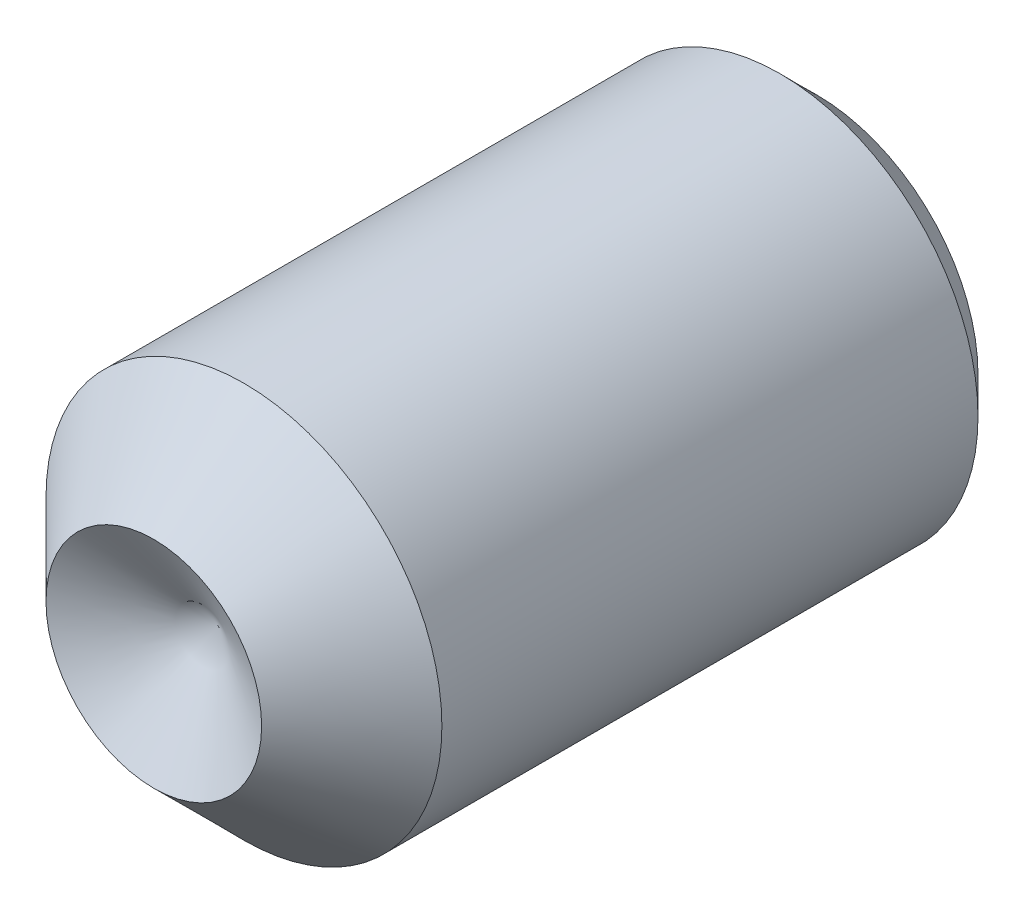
ISO-10303-21;
HEADER;
FILE_DESCRIPTION(('STEP AP214'),'2;1');
FILE_NAME('part.step','',(''),(''),'','','');
FILE_SCHEMA(('AUTOMOTIVE_DESIGN { 1 0 10303 214 1 1 1 1 }'));
ENDSEC;
DATA;
#1=APPLICATION_CONTEXT('core data for automotive mechanical design processes');
#2=APPLICATION_PROTOCOL_DEFINITION('international standard','automotive_design',2000,#1);
#3=PRODUCT_CONTEXT('',#1,'mechanical');
#4=PRODUCT('Part','Part','',(#3));
#5=PRODUCT_RELATED_PRODUCT_CATEGORY('part','',(#4));
#6=PRODUCT_DEFINITION_FORMATION('','',#4);
#7=PRODUCT_DEFINITION_CONTEXT('part definition',#1,'design');
#8=PRODUCT_DEFINITION('design','',#6,#7);
#9=PRODUCT_DEFINITION_SHAPE('','',#8);
#10=(LENGTH_UNIT() NAMED_UNIT(*) SI_UNIT(.MILLI.,.METRE.));
#11=(NAMED_UNIT(*) PLANE_ANGLE_UNIT() SI_UNIT($,.RADIAN.));
#12=(NAMED_UNIT(*) SI_UNIT($,.STERADIAN.) SOLID_ANGLE_UNIT());
#13=UNCERTAINTY_MEASURE_WITH_UNIT(LENGTH_MEASURE(1.E-05),#10,'distance_accuracy_value','');
#14=(GEOMETRIC_REPRESENTATION_CONTEXT(3) GLOBAL_UNCERTAINTY_ASSIGNED_CONTEXT((#13)) GLOBAL_UNIT_ASSIGNED_CONTEXT((#10,
#11,#12)) REPRESENTATION_CONTEXT('',''));
#15=CARTESIAN_POINT('',(0.,0.,0.));
#16=DIRECTION('',(0.,0.,1.));
#17=DIRECTION('',(1.,0.,0.));
#18=AXIS2_PLACEMENT_3D('',#15,#16,#17);
#19=CARTESIAN_POINT('',(0.,0.,4.7625));
#20=DIRECTION('',(0.,0.,-1.));
#21=DIRECTION('',(-1.,0.,0.));
#22=AXIS2_PLACEMENT_3D('',#19,#20,#21);
#23=CYLINDRICAL_SURFACE('',#22,1.4224);
#24=CARTESIAN_POINT('',(0.,0.,0.262466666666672));
#25=DIRECTION('',(0.,0.,1.));
#26=DIRECTION('',(1.,0.,0.));
#27=AXIS2_PLACEMENT_3D('',#24,#25,#26);
#28=CIRCLE('',#27,1.4224);
#29=CARTESIAN_POINT('',(-1.4224,0.,0.262466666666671));
#30=VERTEX_POINT('',#29);
#31=EDGE_CURVE('E46',#30,#30,#28,.T.);
#32=CARTESIAN_POINT('',(0.,0.,4.1148));
#33=DIRECTION('',(0.,0.,-1.));
#34=DIRECTION('',(-1.,0.,0.));
#35=AXIS2_PLACEMENT_3D('',#32,#33,#34);
#36=CIRCLE('',#35,1.4224);
#37=CARTESIAN_POINT('',(-1.4224,0.,4.1148));
#38=VERTEX_POINT('',#37);
#39=EDGE_CURVE('E147',#38,#38,#36,.T.);
#40=CARTESIAN_POINT('',(-1.4224,0.,0.262466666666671));
#41=CARTESIAN_POINT('',(-1.4224,0.,0.302595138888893));
#42=CARTESIAN_POINT('',(-1.4224,0.,0.342723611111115));
#43=CARTESIAN_POINT('',(-1.4224,0.,0.422980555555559));
#44=CARTESIAN_POINT('',(-1.4224,0.,0.463109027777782));
#45=CARTESIAN_POINT('',(-1.4224,0.,0.543365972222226));
#46=CARTESIAN_POINT('',(-1.4224,0.,0.583494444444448));
#47=CARTESIAN_POINT('',(-1.4224,0.,0.663751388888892));
#48=CARTESIAN_POINT('',(-1.4224,0.,0.703879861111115));
#49=CARTESIAN_POINT('',(-1.4224,0.,0.784136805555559));
#50=CARTESIAN_POINT('',(-1.4224,0.,0.824265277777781));
#51=CARTESIAN_POINT('',(-1.4224,0.,0.904522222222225));
#52=CARTESIAN_POINT('',(-1.4224,0.,0.944650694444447));
#53=CARTESIAN_POINT('',(-1.4224,0.,1.02490763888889));
#54=CARTESIAN_POINT('',(-1.4224,0.,1.06503611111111));
#55=CARTESIAN_POINT('',(-1.4224,0.,1.14529305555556));
#56=CARTESIAN_POINT('',(-1.4224,0.,1.18542152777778));
#57=CARTESIAN_POINT('',(-1.4224,0.,1.26567847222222));
#58=CARTESIAN_POINT('',(-1.4224,0.,1.30580694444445));
#59=CARTESIAN_POINT('',(-1.4224,0.,1.38606388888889));
#60=CARTESIAN_POINT('',(-1.4224,0.,1.42619236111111));
#61=CARTESIAN_POINT('',(-1.4224,0.,1.50644930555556));
#62=CARTESIAN_POINT('',(-1.4224,0.,1.54657777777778));
#63=CARTESIAN_POINT('',(-1.4224,0.,1.62683472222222));
#64=CARTESIAN_POINT('',(-1.4224,0.,1.66696319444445));
#65=CARTESIAN_POINT('',(-1.4224,0.,1.74722013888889));
#66=CARTESIAN_POINT('',(-1.4224,0.,1.78734861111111));
#67=CARTESIAN_POINT('',(-1.4224,0.,1.86760555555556));
#68=CARTESIAN_POINT('',(-1.4224,0.,1.90773402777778));
#69=CARTESIAN_POINT('',(-1.4224,0.,1.98799097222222));
#70=CARTESIAN_POINT('',(-1.4224,0.,2.02811944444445));
#71=CARTESIAN_POINT('',(-1.4224,0.,2.10837638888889));
#72=CARTESIAN_POINT('',(-1.4224,0.,2.14850486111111));
#73=CARTESIAN_POINT('',(-1.4224,0.,2.22876180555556));
#74=CARTESIAN_POINT('',(-1.4224,0.,2.26889027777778));
#75=CARTESIAN_POINT('',(-1.4224,0.,2.34914722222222));
#76=CARTESIAN_POINT('',(-1.4224,0.,2.38927569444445));
#77=CARTESIAN_POINT('',(-1.4224,0.,2.46953263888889));
#78=CARTESIAN_POINT('',(-1.4224,0.,2.50966111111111));
#79=CARTESIAN_POINT('',(-1.4224,0.,2.58991805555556));
#80=CARTESIAN_POINT('',(-1.4224,0.,2.63004652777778));
#81=CARTESIAN_POINT('',(-1.4224,0.,2.71030347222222));
#82=CARTESIAN_POINT('',(-1.4224,0.,2.75043194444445));
#83=CARTESIAN_POINT('',(-1.4224,0.,2.83068888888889));
#84=CARTESIAN_POINT('',(-1.4224,0.,2.87081736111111));
#85=CARTESIAN_POINT('',(-1.4224,0.,2.95107430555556));
#86=CARTESIAN_POINT('',(-1.4224,0.,2.99120277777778));
#87=CARTESIAN_POINT('',(-1.4224,0.,3.07145972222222));
#88=CARTESIAN_POINT('',(-1.4224,0.,3.11158819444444));
#89=CARTESIAN_POINT('',(-1.4224,0.,3.19184513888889));
#90=CARTESIAN_POINT('',(-1.4224,0.,3.23197361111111));
#91=CARTESIAN_POINT('',(-1.4224,0.,3.31223055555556));
#92=CARTESIAN_POINT('',(-1.4224,0.,3.35235902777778));
#93=CARTESIAN_POINT('',(-1.4224,0.,3.43261597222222));
#94=CARTESIAN_POINT('',(-1.4224,0.,3.47274444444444));
#95=CARTESIAN_POINT('',(-1.4224,0.,3.55300138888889));
#96=CARTESIAN_POINT('',(-1.4224,0.,3.59312986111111));
#97=CARTESIAN_POINT('',(-1.4224,0.,3.67338680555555));
#98=CARTESIAN_POINT('',(-1.4224,0.,3.71351527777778));
#99=CARTESIAN_POINT('',(-1.4224,0.,3.79377222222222));
#100=CARTESIAN_POINT('',(-1.4224,0.,3.83390069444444));
#101=CARTESIAN_POINT('',(-1.4224,0.,3.91415763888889));
#102=CARTESIAN_POINT('',(-1.4224,0.,3.95428611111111));
#103=CARTESIAN_POINT('',(-1.4224,0.,4.03454305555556));
#104=CARTESIAN_POINT('',(-1.4224,0.,4.07467152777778));
#105=CARTESIAN_POINT('',(-1.4224,0.,4.1148));
#106=B_SPLINE_CURVE_WITH_KNOTS('',3,(#40,#41,#42,#43,#44,#45,#46,#47,#48,#49,#50,#51,#52,#53,
#54,#55,#56,#57,#58,#59,#60,#61,#62,#63,#64,#65,#66,#67,#68,#69,#70,#71,#72,#73,#74,#75,#76,#77,
#78,#79,#80,#81,#82,#83,#84,#85,#86,#87,#88,#89,#90,#91,#92,#93,#94,#95,#96,#97,#98,#99,#100,
#101,#102,#103,#104,#105),.UNSPECIFIED.,.F.,.F.,(4,2,2,2,2,2,2,2,2,2,2,2,2,2,2,2,2,2,2,2,2,2,2,
2,2,2,2,2,2,2,2,2,4),(0.,0.120385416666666,0.240770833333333,0.36115625,0.481541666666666,
0.601927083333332,0.722312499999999,0.842697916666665,0.963083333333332,1.08346875,
1.20385416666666,1.32423958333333,1.444625,1.56501041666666,1.68539583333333,1.80578125,
1.92616666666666,2.04655208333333,2.1669375,2.28732291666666,2.40770833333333,2.52809375,
2.64847916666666,2.76886458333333,2.88925,3.00963541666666,3.13002083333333,3.25040625,
3.37079166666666,3.49117708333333,3.61156249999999,3.73194791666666,3.85233333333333),.UNSPECIFIED.);
#107=EDGE_CURVE('BSEAM38',#30,#38,#106,.T.);
#108=ORIENTED_EDGE('',*,*,#31,.T.);
#109=ORIENTED_EDGE('',*,*,#39,.T.);
#110=ORIENTED_EDGE('',*,*,#107,.T.);
#111=ORIENTED_EDGE('',*,*,#107,.F.);
#112=EDGE_LOOP('',(#108,#110,#109,#111));
#113=FACE_BOUND('',#112,.T.);
#114=ADVANCED_FACE('F38',(#113),#23,.T.);
#115=CARTESIAN_POINT('',(0.,0.,0.));
#116=DIRECTION('',(0.,0.,1.));
#117=DIRECTION('',(1.,0.,0.));
#118=AXIS2_PLACEMENT_3D('',#115,#116,#117);
#119=PLANE('',#118);
#120=CARTESIAN_POINT('',(0.,0.,0.));
#121=DIRECTION('',(0.,0.,1.));
#122=DIRECTION('',(1.,0.,0.));
#123=AXIS2_PLACEMENT_3D('',#120,#121,#122);
#124=CIRCLE('',#123,1.15993333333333);
#125=CARTESIAN_POINT('',(1.15993333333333,0.,0.));
#126=VERTEX_POINT('',#125);
#127=EDGE_CURVE('E11',#126,#126,#124,.F.);
#128=ORIENTED_EDGE('',*,*,#127,.T.);
#129=EDGE_LOOP('',(#128));
#130=FACE_BOUND('',#129,.T.);
#131=DIRECTION('',(-0.866025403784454,-0.499999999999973,0.));
#132=VECTOR('',#131,1.);
#133=CARTESIAN_POINT('',(0.,0.733234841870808,0.));
#134=LINE('',#133,#132);
#135=CARTESIAN_POINT('',(0.,0.733234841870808,0.));
#136=VERTEX_POINT('',#135);
#137=CARTESIAN_POINT('',(-0.635000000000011,0.366617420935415,0.));
#138=VERTEX_POINT('',#137);
#139=EDGE_CURVE('E125',#136,#138,#134,.T.);
#140=ORIENTED_EDGE('',*,*,#139,.T.);
#141=DIRECTION('',(0.,1.,0.));
#142=VECTOR('',#141,1.);
#143=CARTESIAN_POINT('',(-0.635000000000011,-0.366617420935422,0.));
#144=LINE('',#143,#142);
#145=CARTESIAN_POINT('',(-0.635000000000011,-0.366617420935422,0.));
#146=VERTEX_POINT('',#145);
#147=EDGE_CURVE('E53',#146,#138,#144,.T.);
#148=ORIENTED_EDGE('',*,*,#147,.F.);
#149=DIRECTION('',(-0.866025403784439,0.5,0.));
#150=VECTOR('',#149,1.);
#151=CARTESIAN_POINT('',(0.,-0.733234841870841,0.));
#152=LINE('',#151,#150);
#153=CARTESIAN_POINT('',(0.,-0.733234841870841,0.));
#154=VERTEX_POINT('',#153);
#155=EDGE_CURVE('E112',#154,#146,#152,.T.);
#156=ORIENTED_EDGE('',*,*,#155,.F.);
#157=DIRECTION('',(0.866025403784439,0.5,0.));
#158=VECTOR('',#157,1.);
#159=CARTESIAN_POINT('',(0.,-0.733234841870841,0.));
#160=LINE('',#159,#158);
#161=CARTESIAN_POINT('',(0.635000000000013,-0.366617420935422,0.));
#162=VERTEX_POINT('',#161);
#163=EDGE_CURVE('E115',#154,#162,#160,.T.);
#164=ORIENTED_EDGE('',*,*,#163,.T.);
#165=DIRECTION('',(0.,1.,0.));
#166=VECTOR('',#165,1.);
#167=CARTESIAN_POINT('',(0.635000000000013,-0.366617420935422,0.));
#168=LINE('',#167,#166);
#169=CARTESIAN_POINT('',(0.635000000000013,0.366617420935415,0.));
#170=VERTEX_POINT('',#169);
#171=EDGE_CURVE('E130',#162,#170,#168,.T.);
#172=ORIENTED_EDGE('',*,*,#171,.T.);
#173=DIRECTION('',(0.866025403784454,-0.499999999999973,0.));
#174=VECTOR('',#173,1.);
#175=CARTESIAN_POINT('',(0.,0.733234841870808,0.));
#176=LINE('',#175,#174);
#177=EDGE_CURVE('E127',#136,#170,#176,.T.);
#178=ORIENTED_EDGE('',*,*,#177,.F.);
#179=EDGE_LOOP('',(#140,#148,#156,#164,#172,#178));
#180=FACE_BOUND('',#179,.T.);
#181=ADVANCED_FACE('F162',(#130,#180),#119,.F.);
#182=CARTESIAN_POINT('',(0.,0.,4.7625));
#183=DIRECTION('',(0.,0.,-1.));
#184=DIRECTION('',(-1.,0.,0.));
#185=AXIS2_PLACEMENT_3D('',#182,#183,#184);
#186=CONICAL_SURFACE('',#185,0.7747,0.785398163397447);
#187=ORIENTED_EDGE('',*,*,#39,.F.);
#188=EDGE_LOOP('',(#187));
#189=FACE_BOUND('',#188,.T.);
#190=CARTESIAN_POINT('',(0.,0.,4.7625));
#191=DIRECTION('',(0.,0.,-1.));
#192=DIRECTION('',(-1.,0.,0.));
#193=AXIS2_PLACEMENT_3D('',#190,#191,#192);
#194=CIRCLE('',#193,0.7747);
#195=CARTESIAN_POINT('',(-0.7747,0.,4.7625));
#196=VERTEX_POINT('',#195);
#197=EDGE_CURVE('E137',#196,#196,#194,.T.);
#198=ORIENTED_EDGE('',*,*,#197,.T.);
#199=EDGE_LOOP('',(#198));
#200=FACE_BOUND('',#199,.T.);
#201=ADVANCED_FACE('F166',(#189,#200),#186,.T.);
#202=CARTESIAN_POINT('',(0.,0.,4.29701327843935));
#203=DIRECTION('',(0.,0.,1.));
#204=DIRECTION('',(1.,0.,0.));
#205=AXIS2_PLACEMENT_3D('',#202,#203,#204);
#206=CONICAL_SURFACE('',#205,0.,1.02974425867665);
#207=ORIENTED_EDGE('',*,*,#197,.F.);
#208=EDGE_LOOP('',(#207));
#209=FACE_BOUND('',#208,.T.);
#210=CARTESIAN_POINT('',(0.,0.,4.29701327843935));
#211=VERTEX_POINT('',#210);
#212=VERTEX_LOOP('',#211);
#213=FACE_BOUND('',#212,.T.);
#214=ADVANCED_FACE('F172',(#209,#213),#206,.F.);
#215=CARTESIAN_POINT('',(-0.635000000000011,-0.366617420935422,1.27));
#216=DIRECTION('',(-1.,0.,0.));
#217=DIRECTION('',(0.,0.,1.));
#218=AXIS2_PLACEMENT_3D('',#215,#216,#217);
#219=PLANE('',#218);
#220=ORIENTED_EDGE('',*,*,#147,.T.);
#221=DIRECTION('',(0.,0.,-1.));
#222=VECTOR('',#221,1.);
#223=CARTESIAN_POINT('',(-0.635000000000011,0.366617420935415,1.27));
#224=LINE('',#223,#222);
#225=CARTESIAN_POINT('',(-0.635000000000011,0.366617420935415,1.27));
#226=VERTEX_POINT('',#225);
#227=EDGE_CURVE('E94',#226,#138,#224,.T.);
#228=ORIENTED_EDGE('',*,*,#227,.F.);
#229=DIRECTION('',(0.,1.,0.));
#230=VECTOR('',#229,1.);
#231=CARTESIAN_POINT('',(-0.635000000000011,-0.366617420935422,1.27));
#232=LINE('',#231,#230);
#233=CARTESIAN_POINT('',(-0.635000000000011,-0.366617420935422,1.27));
#234=VERTEX_POINT('',#233);
#235=EDGE_CURVE('E102',#234,#226,#232,.T.);
#236=ORIENTED_EDGE('',*,*,#235,.F.);
#237=DIRECTION('',(0.,0.,-1.));
#238=VECTOR('',#237,1.);
#239=CARTESIAN_POINT('',(-0.635000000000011,-0.366617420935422,1.27));
#240=LINE('',#239,#238);
#241=EDGE_CURVE('E135',#234,#146,#240,.T.);
#242=ORIENTED_EDGE('',*,*,#241,.T.);
#243=EDGE_LOOP('',(#220,#228,#236,#242));
#244=FACE_BOUND('',#243,.T.);
#245=ADVANCED_FACE('F105',(#244),#219,.F.);
#246=CARTESIAN_POINT('',(0.,-0.733234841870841,1.27));
#247=DIRECTION('',(-0.5,-0.866025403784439,0.));
#248=DIRECTION('',(0.866025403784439,-0.5,0.));
#249=AXIS2_PLACEMENT_3D('',#246,#247,#248);
#250=PLANE('',#249);
#251=ORIENTED_EDGE('',*,*,#155,.T.);
#252=ORIENTED_EDGE('',*,*,#241,.F.);
#253=DIRECTION('',(-0.866025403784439,0.5,0.));
#254=VECTOR('',#253,1.);
#255=CARTESIAN_POINT('',(0.,-0.733234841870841,1.27));
#256=LINE('',#255,#254);
#257=CARTESIAN_POINT('',(0.,-0.733234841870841,1.27));
#258=VERTEX_POINT('',#257);
#259=EDGE_CURVE('E107',#258,#234,#256,.T.);
#260=ORIENTED_EDGE('',*,*,#259,.F.);
#261=DIRECTION('',(0.,0.,-1.));
#262=VECTOR('',#261,1.);
#263=CARTESIAN_POINT('',(0.,-0.733234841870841,1.27));
#264=LINE('',#263,#262);
#265=EDGE_CURVE('E138',#258,#154,#264,.T.);
#266=ORIENTED_EDGE('',*,*,#265,.T.);
#267=EDGE_LOOP('',(#251,#252,#260,#266));
#268=FACE_BOUND('',#267,.T.);
#269=ADVANCED_FACE('F179',(#268),#250,.F.);
#270=CARTESIAN_POINT('',(0.,-0.733234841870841,1.27));
#271=DIRECTION('',(-0.5,0.866025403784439,0.));
#272=DIRECTION('',(-0.866025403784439,-0.5,0.));
#273=AXIS2_PLACEMENT_3D('',#270,#271,#272);
#274=PLANE('',#273);
#275=ORIENTED_EDGE('',*,*,#163,.F.);
#276=ORIENTED_EDGE('',*,*,#265,.F.);
#277=DIRECTION('',(0.866025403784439,0.5,0.));
#278=VECTOR('',#277,1.);
#279=CARTESIAN_POINT('',(0.,-0.733234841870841,1.27));
#280=LINE('',#279,#278);
#281=CARTESIAN_POINT('',(0.635000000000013,-0.366617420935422,1.27));
#282=VERTEX_POINT('',#281);
#283=EDGE_CURVE('E121',#258,#282,#280,.T.);
#284=ORIENTED_EDGE('',*,*,#283,.T.);
#285=DIRECTION('',(0.,0.,-1.));
#286=VECTOR('',#285,1.);
#287=CARTESIAN_POINT('',(0.635000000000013,-0.366617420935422,1.27));
#288=LINE('',#287,#286);
#289=EDGE_CURVE('E140',#282,#162,#288,.T.);
#290=ORIENTED_EDGE('',*,*,#289,.T.);
#291=EDGE_LOOP('',(#275,#276,#284,#290));
#292=FACE_BOUND('',#291,.T.);
#293=ADVANCED_FACE('F189',(#292),#274,.T.);
#294=CARTESIAN_POINT('',(0.635000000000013,-0.366617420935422,1.27));
#295=DIRECTION('',(-1.,0.,0.));
#296=DIRECTION('',(0.,0.,1.));
#297=AXIS2_PLACEMENT_3D('',#294,#295,#296);
#298=PLANE('',#297);
#299=ORIENTED_EDGE('',*,*,#171,.F.);
#300=ORIENTED_EDGE('',*,*,#289,.F.);
#301=DIRECTION('',(0.,1.,0.));
#302=VECTOR('',#301,1.);
#303=CARTESIAN_POINT('',(0.635000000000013,-0.366617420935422,1.27));
#304=LINE('',#303,#302);
#305=CARTESIAN_POINT('',(0.635000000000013,0.366617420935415,1.27));
#306=VERTEX_POINT('',#305);
#307=EDGE_CURVE('E119',#282,#306,#304,.T.);
#308=ORIENTED_EDGE('',*,*,#307,.T.);
#309=DIRECTION('',(0.,0.,-1.));
#310=VECTOR('',#309,1.);
#311=CARTESIAN_POINT('',(0.635000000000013,0.366617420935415,1.27));
#312=LINE('',#311,#310);
#313=EDGE_CURVE('E142',#306,#170,#312,.T.);
#314=ORIENTED_EDGE('',*,*,#313,.T.);
#315=EDGE_LOOP('',(#299,#300,#308,#314));
#316=FACE_BOUND('',#315,.T.);
#317=ADVANCED_FACE('F185',(#316),#298,.T.);
#318=CARTESIAN_POINT('',(0.,0.733234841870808,1.27));
#319=DIRECTION('',(0.499999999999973,0.866025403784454,0.));
#320=DIRECTION('',(-0.866025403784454,0.499999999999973,0.));
#321=AXIS2_PLACEMENT_3D('',#318,#319,#320);
#322=PLANE('',#321);
#323=ORIENTED_EDGE('',*,*,#177,.T.);
#324=ORIENTED_EDGE('',*,*,#313,.F.);
#325=DIRECTION('',(0.866025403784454,-0.499999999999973,0.));
#326=VECTOR('',#325,1.);
#327=CARTESIAN_POINT('',(0.,0.733234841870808,1.27));
#328=LINE('',#327,#326);
#329=CARTESIAN_POINT('',(0.,0.733234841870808,1.27));
#330=VERTEX_POINT('',#329);
#331=EDGE_CURVE('E101',#330,#306,#328,.T.);
#332=ORIENTED_EDGE('',*,*,#331,.F.);
#333=DIRECTION('',(0.,0.,-1.));
#334=VECTOR('',#333,1.);
#335=CARTESIAN_POINT('',(0.,0.733234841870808,1.27));
#336=LINE('',#335,#334);
#337=EDGE_CURVE('E96',#330,#136,#336,.T.);
#338=ORIENTED_EDGE('',*,*,#337,.T.);
#339=EDGE_LOOP('',(#323,#324,#332,#338));
#340=FACE_BOUND('',#339,.T.);
#341=ADVANCED_FACE('F182',(#340),#322,.F.);
#342=CARTESIAN_POINT('',(0.,0.733234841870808,1.27));
#343=DIRECTION('',(0.499999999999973,-0.866025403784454,0.));
#344=DIRECTION('',(0.866025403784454,0.499999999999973,0.));
#345=AXIS2_PLACEMENT_3D('',#342,#343,#344);
#346=PLANE('',#345);
#347=ORIENTED_EDGE('',*,*,#139,.F.);
#348=ORIENTED_EDGE('',*,*,#337,.F.);
#349=DIRECTION('',(-0.866025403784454,-0.499999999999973,0.));
#350=VECTOR('',#349,1.);
#351=CARTESIAN_POINT('',(0.,0.733234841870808,1.27));
#352=LINE('',#351,#350);
#353=EDGE_CURVE('E91',#330,#226,#352,.T.);
#354=ORIENTED_EDGE('',*,*,#353,.T.);
#355=ORIENTED_EDGE('',*,*,#227,.T.);
#356=EDGE_LOOP('',(#347,#348,#354,#355));
#357=FACE_BOUND('',#356,.T.);
#358=ADVANCED_FACE('F93',(#357),#346,.T.);
#359=CARTESIAN_POINT('',(-0.635000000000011,0.366617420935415,1.27));
#360=DIRECTION('',(0.,0.,1.));
#361=DIRECTION('',(1.,0.,0.));
#362=AXIS2_PLACEMENT_3D('',#359,#360,#361);
#363=PLANE('',#362);
#364=ORIENTED_EDGE('',*,*,#235,.T.);
#365=ORIENTED_EDGE('',*,*,#353,.F.);
#366=ORIENTED_EDGE('',*,*,#331,.T.);
#367=ORIENTED_EDGE('',*,*,#307,.F.);
#368=ORIENTED_EDGE('',*,*,#283,.F.);
#369=ORIENTED_EDGE('',*,*,#259,.T.);
#370=EDGE_LOOP('',(#364,#365,#366,#367,#368,#369));
#371=FACE_BOUND('',#370,.T.);
#372=ADVANCED_FACE('F109',(#371),#363,.F.);
#373=CARTESIAN_POINT('',(0.,0.,0.262466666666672));
#374=DIRECTION('',(0.,0.,1.));
#375=DIRECTION('',(1.,0.,0.));
#376=AXIS2_PLACEMENT_3D('',#373,#374,#375);
#377=CONICAL_SURFACE('',#376,1.4224,0.785398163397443);
#378=ORIENTED_EDGE('',*,*,#127,.F.);
#379=EDGE_LOOP('',(#378));
#380=FACE_BOUND('',#379,.T.);
#381=ORIENTED_EDGE('',*,*,#31,.F.);
#382=EDGE_LOOP('',(#381));
#383=FACE_BOUND('',#382,.T.);
#384=ADVANCED_FACE('F40',(#380,#383),#377,.T.);
#385=CLOSED_SHELL('',(#114,#181,#201,#214,#245,#269,#293,#317,#341,#358,#372,#384));
#386=MANIFOLD_SOLID_BREP('B2',#385);
#387=ADVANCED_BREP_SHAPE_REPRESENTATION('',(#18,#386),#14);
#388=SHAPE_DEFINITION_REPRESENTATION(#9,#387);
ENDSEC;
END-ISO-10303-21;
